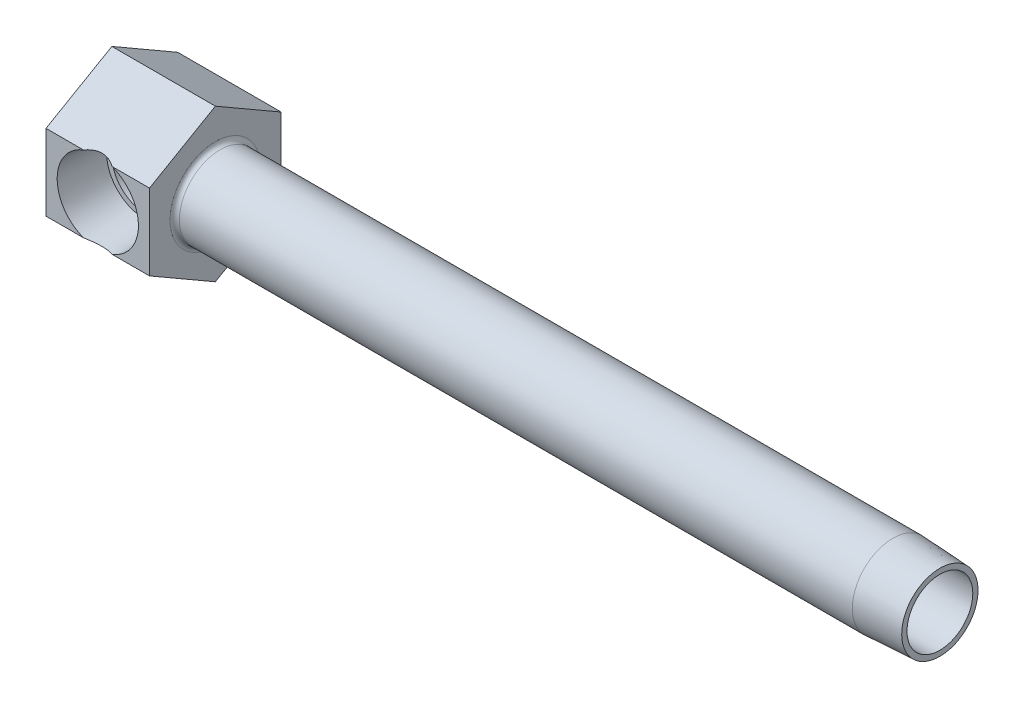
ISO-10303-21;
HEADER;
FILE_DESCRIPTION(('STEP AP214'),'2;1');
FILE_NAME('part.step','',(''),(''),'','','');
FILE_SCHEMA(('AUTOMOTIVE_DESIGN { 1 0 10303 214 1 1 1 1 }'));
ENDSEC;
DATA;
#1=APPLICATION_CONTEXT('core data for automotive mechanical design processes');
#2=APPLICATION_PROTOCOL_DEFINITION('international standard','automotive_design',2000,#1);
#3=PRODUCT_CONTEXT('',#1,'mechanical');
#4=PRODUCT('Part','Part','',(#3));
#5=PRODUCT_RELATED_PRODUCT_CATEGORY('part','',(#4));
#6=PRODUCT_DEFINITION_FORMATION('','',#4);
#7=PRODUCT_DEFINITION_CONTEXT('part definition',#1,'design');
#8=PRODUCT_DEFINITION('design','',#6,#7);
#9=PRODUCT_DEFINITION_SHAPE('','',#8);
#10=(LENGTH_UNIT() NAMED_UNIT(*) SI_UNIT(.MILLI.,.METRE.));
#11=(NAMED_UNIT(*) PLANE_ANGLE_UNIT() SI_UNIT($,.RADIAN.));
#12=(NAMED_UNIT(*) SI_UNIT($,.STERADIAN.) SOLID_ANGLE_UNIT());
#13=UNCERTAINTY_MEASURE_WITH_UNIT(LENGTH_MEASURE(1.E-05),#10,'distance_accuracy_value','');
#14=(GEOMETRIC_REPRESENTATION_CONTEXT(3) GLOBAL_UNCERTAINTY_ASSIGNED_CONTEXT((#13)) GLOBAL_UNIT_ASSIGNED_CONTEXT((#10,
#11,#12)) REPRESENTATION_CONTEXT('',''));
#15=CARTESIAN_POINT('',(0.,0.,0.));
#16=DIRECTION('',(0.,0.,1.));
#17=DIRECTION('',(1.,0.,0.));
#18=AXIS2_PLACEMENT_3D('',#15,#16,#17);
#19=CARTESIAN_POINT('',(8.7376,0.,22.225));
#20=DIRECTION('',(0.,0.,1.));
#21=DIRECTION('',(1.,0.,0.));
#22=AXIS2_PLACEMENT_3D('',#19,#20,#21);
#23=CONICAL_SURFACE('',#22,6.858,0.0523598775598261);
#24=CARTESIAN_POINT('',(8.7376,-0.680996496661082,34.5170205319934));
#25=DIRECTION('',(0.,-0.866025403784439,-0.5));
#26=DIRECTION('',(0.,-0.5,0.866025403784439));
#27=AXIS2_PLACEMENT_3D('',#24,#25,#26);
#28=ELLIPSE('',#27,15.0043949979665,7.47122554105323);
#29=CARTESIAN_POINT('',(11.1603281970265,6.4158048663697,22.225));
#30=VERTEX_POINT('',#29);
#31=CARTESIAN_POINT('',(6.3148718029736,6.4158048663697,22.225));
#32=VERTEX_POINT('',#31);
#33=EDGE_CURVE('E180',#30,#32,#28,.F.);
#34=ORIENTED_EDGE('',*,*,#33,.T.);
#35=CARTESIAN_POINT('',(8.7376,0.,22.225));
#36=DIRECTION('',(0.,0.,-1.));
#37=DIRECTION('',(-1.,0.,0.));
#38=AXIS2_PLACEMENT_3D('',#35,#36,#37);
#39=CIRCLE('',#38,6.858);
#40=CARTESIAN_POINT('',(6.31487180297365,-6.41580486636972,22.225));
#41=VERTEX_POINT('',#40);
#42=EDGE_CURVE('E38',#41,#32,#39,.T.);
#43=ORIENTED_EDGE('',*,*,#42,.F.);
#44=CARTESIAN_POINT('',(8.7376,0.680996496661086,34.5170205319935));
#45=DIRECTION('',(0.,0.866025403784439,-0.5));
#46=DIRECTION('',(0.,0.5,0.866025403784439));
#47=AXIS2_PLACEMENT_3D('',#44,#45,#46);
#48=ELLIPSE('',#47,15.0043949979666,7.47122554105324);
#49=CARTESIAN_POINT('',(11.1603281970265,-6.4158048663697,22.225));
#50=VERTEX_POINT('',#49);
#51=EDGE_CURVE('E23',#41,#50,#48,.F.);
#52=ORIENTED_EDGE('',*,*,#51,.T.);
#53=EDGE_CURVE('E174',#30,#50,#39,.T.);
#54=ORIENTED_EDGE('',*,*,#53,.F.);
#55=EDGE_LOOP('',(#34,#43,#52,#54));
#56=FACE_BOUND('',#55,.T.);
#57=CARTESIAN_POINT('',(8.7376,0.,14.3002));
#58=DIRECTION('',(0.,0.,-1.));
#59=DIRECTION('',(-1.,0.,0.));
#60=AXIS2_PLACEMENT_3D('',#57,#58,#59);
#61=CIRCLE('',#60,6.44267883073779);
#62=CARTESIAN_POINT('',(13.3057672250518,-4.54312213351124,14.3002));
#63=VERTEX_POINT('',#62);
#64=CARTESIAN_POINT('',(13.3057672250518,4.54312213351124,14.3002));
#65=VERTEX_POINT('',#64);
#66=EDGE_CURVE('E172',#63,#65,#61,.T.);
#67=ORIENTED_EDGE('',*,*,#66,.T.);
#68=CARTESIAN_POINT('',(13.3056128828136,4.5432624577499,14.3));
#69=CARTESIAN_POINT('',(13.4050037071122,4.45290836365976,14.4287190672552));
#70=CARTESIAN_POINT('',(13.5038252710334,4.35690222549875,14.5539811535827));
#71=CARTESIAN_POINT('',(13.6989301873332,4.15324987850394,14.7972290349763));
#72=CARTESIAN_POINT('',(13.7952093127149,4.04558563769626,14.9152031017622));
#73=CARTESIAN_POINT('',(13.9843700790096,3.8175241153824,15.1441485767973));
#74=CARTESIAN_POINT('',(14.0772125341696,3.69701926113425,15.25504596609));
#75=CARTESIAN_POINT('',(14.2568464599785,3.44414434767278,15.4675620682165));
#76=CARTESIAN_POINT('',(14.3436418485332,3.31178210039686,15.5691868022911));
#77=CARTESIAN_POINT('',(14.5527686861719,2.96297657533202,15.8122617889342));
#78=CARTESIAN_POINT('',(14.6701286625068,2.73858307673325,15.9469651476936));
#79=CARTESIAN_POINT('',(14.8276174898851,2.38307262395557,16.1264780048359));
#80=CARTESIAN_POINT('',(14.8769849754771,2.26153631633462,16.1825173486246));
#81=CARTESIAN_POINT('',(14.9687772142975,2.01251511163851,16.2864098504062));
#82=CARTESIAN_POINT('',(15.0112056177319,1.88503338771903,16.3342673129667));
#83=CARTESIAN_POINT('',(15.088733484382,1.62324870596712,16.4215218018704));
#84=CARTESIAN_POINT('',(15.1237419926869,1.4888836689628,16.4608139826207));
#85=CARTESIAN_POINT('',(15.1849785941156,1.21573970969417,16.5294343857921));
#86=CARTESIAN_POINT('',(15.2112114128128,1.07696320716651,16.5587679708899));
#87=CARTESIAN_POINT('',(15.2542466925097,0.796159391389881,16.6068431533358));
#88=CARTESIAN_POINT('',(15.2710505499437,0.654132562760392,16.6255863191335));
#89=CARTESIAN_POINT('',(15.2947665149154,0.368243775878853,16.6520290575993));
#90=CARTESIAN_POINT('',(15.3016803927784,0.224382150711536,16.6597306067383));
#91=CARTESIAN_POINT('',(15.3051381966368,-0.0413792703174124,16.6635827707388));
#92=CARTESIAN_POINT('',(15.3031178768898,-0.163241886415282,16.6613326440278));
#93=CARTESIAN_POINT('',(15.2919140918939,-0.406265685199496,16.6488476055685));
#94=CARTESIAN_POINT('',(15.282728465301,-0.527426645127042,16.6386102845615));
#95=CARTESIAN_POINT('',(15.2573805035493,-0.768029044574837,16.6103343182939));
#96=CARTESIAN_POINT('',(15.2412218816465,-0.887471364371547,16.5922998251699));
#97=CARTESIAN_POINT('',(15.2022471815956,-1.1238947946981,16.5487418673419));
#98=CARTESIAN_POINT('',(15.1794285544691,-1.24087494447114,16.5232155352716));
#99=CARTESIAN_POINT('',(15.1030013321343,-1.58064044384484,16.4375716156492));
#100=CARTESIAN_POINT('',(15.0406598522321,-1.79907617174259,16.3675454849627));
#101=CARTESIAN_POINT('',(14.8959772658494,-2.2198653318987,16.2041288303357));
#102=CARTESIAN_POINT('',(14.8136249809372,-2.42220969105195,16.1107252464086));
#103=CARTESIAN_POINT('',(14.6581620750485,-2.75475802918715,15.9330467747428));
#104=CARTESIAN_POINT('',(14.588877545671,-2.88934500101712,15.8534887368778));
#105=CARTESIAN_POINT('',(14.4433958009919,-3.14876465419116,15.6853070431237));
#106=CARTESIAN_POINT('',(14.3671982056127,-3.27359679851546,15.5966828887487));
#107=CARTESIAN_POINT('',(14.2091096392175,-3.51355050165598,15.4112660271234));
#108=CARTESIAN_POINT('',(14.1272094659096,-3.62865566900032,15.3144600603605));
#109=CARTESIAN_POINT('',(13.9591121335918,-3.84892561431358,15.1136697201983));
#110=CARTESIAN_POINT('',(13.8729164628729,-3.95409379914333,15.0096878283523));
#111=CARTESIAN_POINT('',(13.7069469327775,-4.14374167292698,14.806812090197));
#112=CARTESIAN_POINT('',(13.62749258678,-4.22922772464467,14.7085925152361));
#113=CARTESIAN_POINT('',(13.4673498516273,-4.39212627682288,14.5076746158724));
#114=CARTESIAN_POINT('',(13.386669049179,-4.4695749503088,14.4049995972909));
#115=CARTESIAN_POINT('',(13.3056128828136,-4.5432624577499,14.3));
#116=B_SPLINE_CURVE_WITH_KNOTS('',3,(#68,#69,#70,#71,#72,#73,#74,#75,#76,#77,#78,#79,#80,#81,
#82,#83,#84,#85,#86,#87,#88,#89,#90,#91,#92,#93,#94,#95,#96,#97,#98,#99,#100,#101,#102,#103,
#104,#105,#106,#107,#108,#109,#110,#111,#112,#113,#114,#115),.UNSPECIFIED.,.F.,.F.,(4,2,2,2,2,2,
2,2,2,2,2,2,2,2,2,2,2,2,2,2,2,2,2,4),(0.,0.558072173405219,1.11702021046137,1.68108674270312,
2.24478434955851,3.10140634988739,3.52893103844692,3.95623010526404,4.38849766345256,
4.82053207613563,5.25250248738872,5.68439556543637,6.04963287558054,6.41498039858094,
6.7801336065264,7.14542675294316,7.85550743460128,8.56598569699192,9.07835413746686,
9.59075076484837,10.1039943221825,10.6170612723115,11.0743952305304,11.5295724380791),.UNSPECIFIED.);
#117=EDGE_CURVE('E131',#65,#63,#116,.T.);
#118=ORIENTED_EDGE('',*,*,#117,.T.);
#119=EDGE_LOOP('',(#67,#118));
#120=FACE_BOUND('',#119,.T.);
#121=ADVANCED_FACE('F15',(#56,#120),#23,.F.);
#122=CARTESIAN_POINT('',(15.1802788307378,0.,14.3002));
#123=DIRECTION('',(0.,0.,1.));
#124=DIRECTION('',(1.,0.,0.));
#125=AXIS2_PLACEMENT_3D('',#122,#123,#124);
#126=PLANE('',#125);
#127=ORIENTED_EDGE('',*,*,#66,.F.);
#128=DIRECTION('',(1.,0.,0.));
#129=VECTOR('',#128,1.);
#130=CARTESIAN_POINT('',(65.6255637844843,-4.54312213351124,14.3002));
#131=LINE('',#130,#129);
#132=CARTESIAN_POINT('',(11.9253,-4.54312213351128,14.3002));
#133=VERTEX_POINT('',#132);
#134=EDGE_CURVE('E129',#63,#133,#131,.F.);
#135=ORIENTED_EDGE('',*,*,#134,.T.);
#136=CARTESIAN_POINT('',(8.7376,0.,14.3002));
#137=DIRECTION('',(0.,0.,-1.));
#138=DIRECTION('',(-1.,0.,0.));
#139=AXIS2_PLACEMENT_3D('',#136,#137,#138);
#140=CIRCLE('',#139,5.5499);
#141=CARTESIAN_POINT('',(11.9253,4.54312213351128,14.3002));
#142=VERTEX_POINT('',#141);
#143=EDGE_CURVE('E121',#133,#142,#140,.T.);
#144=ORIENTED_EDGE('',*,*,#143,.T.);
#145=DIRECTION('',(1.,0.,0.));
#146=VECTOR('',#145,1.);
#147=CARTESIAN_POINT('',(65.6255637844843,4.54312213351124,14.3002));
#148=LINE('',#147,#146);
#149=EDGE_CURVE('E124',#142,#65,#148,.T.);
#150=ORIENTED_EDGE('',*,*,#149,.T.);
#151=EDGE_LOOP('',(#127,#135,#144,#150));
#152=FACE_BOUND('',#151,.T.);
#153=ADVANCED_FACE('F162',(#152),#126,.T.);
#154=CARTESIAN_POINT('',(8.7376,0.,27.6280516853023));
#155=DIRECTION('',(0.,0.,-1.));
#156=DIRECTION('',(-1.,0.,0.));
#157=AXIS2_PLACEMENT_3D('',#154,#155,#156);
#158=CYLINDRICAL_SURFACE('',#157,5.5499);
#159=ORIENTED_EDGE('',*,*,#143,.F.);
#160=CARTESIAN_POINT('',(8.7376,0.,11.1125));
#161=DIRECTION('',(0.707106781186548,0.,-0.707106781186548));
#162=DIRECTION('',(-0.707106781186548,0.,-0.707106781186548));
#163=AXIS2_PLACEMENT_3D('',#160,#161,#162);
#164=ELLIPSE('',#163,7.84874384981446,5.5499);
#165=CARTESIAN_POINT('',(8.7376,-5.5499,11.1125));
#166=VERTEX_POINT('',#165);
#167=EDGE_CURVE('E110',#133,#166,#164,.T.);
#168=ORIENTED_EDGE('',*,*,#167,.T.);
#169=CARTESIAN_POINT('',(8.7376,0.,11.1125));
#170=DIRECTION('',(-0.707106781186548,0.,-0.707106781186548));
#171=DIRECTION('',(0.707106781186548,0.,-0.707106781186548));
#172=AXIS2_PLACEMENT_3D('',#169,#170,#171);
#173=ELLIPSE('',#172,7.84874384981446,5.5499);
#174=CARTESIAN_POINT('',(13.4708637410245,-2.89786203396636,6.37923625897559));
#175=VERTEX_POINT('',#174);
#176=EDGE_CURVE('E106',#166,#175,#173,.F.);
#177=ORIENTED_EDGE('',*,*,#176,.T.);
#178=CARTESIAN_POINT('',(8.7376,0.,6.37923625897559));
#179=DIRECTION('',(0.,0.,-1.));
#180=DIRECTION('',(-1.,0.,0.));
#181=AXIS2_PLACEMENT_3D('',#178,#179,#180);
#182=CIRCLE('',#181,5.5499);
#183=CARTESIAN_POINT('',(13.4708637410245,2.89786203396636,6.37923625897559));
#184=VERTEX_POINT('',#183);
#185=EDGE_CURVE('E177',#175,#184,#182,.T.);
#186=ORIENTED_EDGE('',*,*,#185,.T.);
#187=CARTESIAN_POINT('',(8.7376,5.5499,11.1125));
#188=VERTEX_POINT('',#187);
#189=EDGE_CURVE('E30',#184,#188,#173,.F.);
#190=ORIENTED_EDGE('',*,*,#189,.T.);
#191=EDGE_CURVE('E122',#188,#142,#164,.T.);
#192=ORIENTED_EDGE('',*,*,#191,.T.);
#193=EDGE_LOOP('',(#159,#168,#177,#186,#190,#192));
#194=FACE_BOUND('',#193,.T.);
#195=ADVANCED_FACE('F118',(#194),#158,.F.);
#196=CARTESIAN_POINT('',(8.7376,0.,6.37923625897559));
#197=DIRECTION('',(0.,0.,1.));
#198=DIRECTION('',(1.,0.,0.));
#199=AXIS2_PLACEMENT_3D('',#196,#197,#198);
#200=CONICAL_SURFACE('',#199,5.5499,1.04719755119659);
#201=CARTESIAN_POINT('',(8.7376,0.,3.175));
#202=VERTEX_POINT('',#201);
#203=VERTEX_LOOP('',#202);
#204=FACE_BOUND('',#203,.T.);
#205=ORIENTED_EDGE('',*,*,#185,.F.);
#206=CARTESIAN_POINT('',(13.4710699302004,-2.89818868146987,6.37943625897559));
#207=CARTESIAN_POINT('',(13.420685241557,-2.81852795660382,6.33063423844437));
#208=CARTESIAN_POINT('',(13.3737513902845,-2.73601453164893,6.28289768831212));
#209=CARTESIAN_POINT('',(13.2869939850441,-2.56583570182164,6.19038737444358));
#210=CARTESIAN_POINT('',(13.2471660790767,-2.47817349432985,6.14561180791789));
#211=CARTESIAN_POINT('',(13.1751547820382,-2.29911606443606,6.06025322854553));
#212=CARTESIAN_POINT('',(13.1428940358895,-2.20777091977,6.01963042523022));
#213=CARTESIAN_POINT('',(13.0851463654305,-2.02119544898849,5.9427479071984));
#214=CARTESIAN_POINT('',(13.0596596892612,-1.925964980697,5.90648835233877));
#215=CARTESIAN_POINT('',(13.0148514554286,-1.73255643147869,5.83897057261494));
#216=CARTESIAN_POINT('',(12.9955185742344,-1.63438413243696,5.80770321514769));
#217=CARTESIAN_POINT('',(12.9620830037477,-1.43563345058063,5.75050007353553));
#218=CARTESIAN_POINT('',(12.9479806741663,-1.33505490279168,5.72456465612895));
#219=CARTESIAN_POINT('',(12.9240526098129,-1.13183172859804,5.67823452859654));
#220=CARTESIAN_POINT('',(12.9142392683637,-1.02918199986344,5.65785593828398));
#221=CARTESIAN_POINT('',(12.8981074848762,-0.822623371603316,5.62290462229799));
#222=CARTESIAN_POINT('',(12.891789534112,-0.718714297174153,5.60833271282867));
#223=CARTESIAN_POINT('',(12.8810293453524,-0.489671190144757,5.58281999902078));
#224=CARTESIAN_POINT('',(12.8771967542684,-0.364365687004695,5.57314917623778));
#225=CARTESIAN_POINT('',(12.8729275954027,-0.113319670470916,5.56233429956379));
#226=CARTESIAN_POINT('',(12.8724915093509,0.0124209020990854,5.56119145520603));
#227=CARTESIAN_POINT('',(12.874939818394,0.263686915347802,5.567443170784));
#228=CARTESIAN_POINT('',(12.8778249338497,0.389212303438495,5.57483958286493));
#229=CARTESIAN_POINT('',(12.8874191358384,0.639322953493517,5.59811647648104));
#230=CARTESIAN_POINT('',(12.8941278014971,0.763908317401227,5.61399602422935));
#231=CARTESIAN_POINT('',(12.9116197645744,1.00072761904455,5.65236645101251));
#232=CARTESIAN_POINT('',(12.9220027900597,1.11310193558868,5.67417088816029));
#233=CARTESIAN_POINT('',(12.9479188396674,1.33574469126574,5.724531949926));
#234=CARTESIAN_POINT('',(12.9634519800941,1.44601308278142,5.75308872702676));
#235=CARTESIAN_POINT('',(13.00082798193,1.66326683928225,5.81649299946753));
#236=CARTESIAN_POINT('',(13.022650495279,1.77026157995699,5.8513200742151));
#237=CARTESIAN_POINT('',(13.0737132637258,1.98033019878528,5.92673676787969));
#238=CARTESIAN_POINT('',(13.1029503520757,2.08340572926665,5.9673239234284));
#239=CARTESIAN_POINT('',(13.1785970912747,2.31167706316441,6.06504898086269));
#240=CARTESIAN_POINT('',(13.2275080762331,2.4354192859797,6.12371071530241));
#241=CARTESIAN_POINT('',(13.3111431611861,2.61414296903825,6.21635789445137));
#242=CARTESIAN_POINT('',(13.3408272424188,2.67271819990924,6.24810824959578));
#243=CARTESIAN_POINT('',(13.4034989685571,2.78735967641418,6.31288069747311));
#244=CARTESIAN_POINT('',(13.4364871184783,2.84342553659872,6.34590298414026));
#245=CARTESIAN_POINT('',(13.4710699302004,2.89818868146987,6.37943625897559));
#246=B_SPLINE_CURVE_WITH_KNOTS('',3,(#206,#207,#208,#209,#210,#211,#212,#213,#214,#215,#216,
#217,#218,#219,#220,#221,#222,#223,#224,#225,#226,#227,#228,#229,#230,#231,#232,#233,#234,#235,
#236,#237,#238,#239,#240,#241,#242,#243,#244,#245),.UNSPECIFIED.,.F.,.F.,(4,2,2,2,2,2,2,2,2,2,2,
2,2,2,2,2,2,2,2,4),(0.,0.318348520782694,0.636501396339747,0.951244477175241,1.26599908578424,
1.58017112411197,1.89436476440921,2.20946038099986,2.52460027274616,2.90145665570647,
3.27836648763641,3.65535808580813,4.0323081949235,4.3768235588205,4.721346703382,
5.06476748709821,5.40804184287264,5.8430906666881,6.06180090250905,6.28054461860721),.UNSPECIFIED.);
#247=EDGE_CURVE('E112',#175,#184,#246,.T.);
#248=ORIENTED_EDGE('',*,*,#247,.T.);
#249=EDGE_LOOP('',(#205,#248));
#250=FACE_BOUND('',#249,.T.);
#251=ADVANCED_FACE('F155',(#204,#250),#200,.F.);
#252=CARTESIAN_POINT('',(139.7,0.,11.1125));
#253=DIRECTION('',(-1.,0.,0.));
#254=DIRECTION('',(0.,0.,1.));
#255=AXIS2_PLACEMENT_3D('',#252,#253,#254);
#256=PLANE('',#255);
#257=CARTESIAN_POINT('',(139.7,0.,11.1125));
#258=DIRECTION('',(-1.,0.,0.));
#259=DIRECTION('',(0.,0.,1.));
#260=AXIS2_PLACEMENT_3D('',#257,#258,#259);
#261=CIRCLE('',#260,6.44267883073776);
#262=CARTESIAN_POINT('',(139.7,0.,17.5551788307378));
#263=VERTEX_POINT('',#262);
#264=EDGE_CURVE('E10',#263,#263,#261,.T.);
#265=ORIENTED_EDGE('',*,*,#264,.F.);
#266=EDGE_LOOP('',(#265));
#267=FACE_BOUND('',#266,.T.);
#268=CARTESIAN_POINT('',(139.7,0.,11.1125));
#269=DIRECTION('',(1.,0.,0.));
#270=DIRECTION('',(0.,0.,-1.));
#271=AXIS2_PLACEMENT_3D('',#268,#269,#270);
#272=CIRCLE('',#271,5.5499);
#273=CARTESIAN_POINT('',(139.7,0.,5.5626));
#274=VERTEX_POINT('',#273);
#275=EDGE_CURVE('E154',#274,#274,#272,.T.);
#276=ORIENTED_EDGE('',*,*,#275,.F.);
#277=EDGE_LOOP('',(#276));
#278=FACE_BOUND('',#277,.T.);
#279=ADVANCED_FACE('F159',(#267,#278),#256,.F.);
#280=CARTESIAN_POINT('',(139.7,0.,11.1125));
#281=DIRECTION('',(-1.,0.,0.));
#282=DIRECTION('',(0.,0.,1.));
#283=AXIS2_PLACEMENT_3D('',#280,#281,#282);
#284=CYLINDRICAL_SURFACE('',#283,6.858);
#285=CARTESIAN_POINT('',(18.2499,0.,11.1125));
#286=DIRECTION('',(-1.,0.,0.));
#287=DIRECTION('',(0.,-1.,0.));
#288=AXIS2_PLACEMENT_3D('',#285,#286,#287);
#289=CIRCLE('',#288,6.858);
#290=CARTESIAN_POINT('',(18.2499,-6.858,11.1125));
#291=VERTEX_POINT('',#290);
#292=EDGE_CURVE('E239',#291,#291,#289,.F.);
#293=ORIENTED_EDGE('',*,*,#292,.T.);
#294=EDGE_LOOP('',(#293));
#295=FACE_BOUND('',#294,.T.);
#296=CARTESIAN_POINT('',(131.7752,0.,11.1125));
#297=DIRECTION('',(-1.,0.,0.));
#298=DIRECTION('',(0.,0.,1.));
#299=AXIS2_PLACEMENT_3D('',#296,#297,#298);
#300=CIRCLE('',#299,6.858);
#301=CARTESIAN_POINT('',(131.7752,0.,17.9705));
#302=VERTEX_POINT('',#301);
#303=EDGE_CURVE('E138',#302,#302,#300,.T.);
#304=ORIENTED_EDGE('',*,*,#303,.T.);
#305=EDGE_LOOP('',(#304));
#306=FACE_BOUND('',#305,.T.);
#307=ADVANCED_FACE('F289',(#295,#306),#284,.T.);
#308=CARTESIAN_POINT('',(17.4625,12.8316097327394,11.1125));
#309=DIRECTION('',(0.,-0.866025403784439,-0.5));
#310=DIRECTION('',(0.,0.5,-0.866025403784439));
#311=AXIS2_PLACEMENT_3D('',#308,#309,#310);
#312=PLANE('',#311);
#313=ORIENTED_EDGE('',*,*,#33,.F.);
#314=DIRECTION('',(-1.,0.,0.));
#315=VECTOR('',#314,1.);
#316=CARTESIAN_POINT('',(17.4625,6.4158048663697,22.225));
#317=LINE('',#316,#315);
#318=CARTESIAN_POINT('',(17.4625,6.4158048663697,22.225));
#319=VERTEX_POINT('',#318);
#320=EDGE_CURVE('E224',#319,#30,#317,.T.);
#321=ORIENTED_EDGE('',*,*,#320,.F.);
#322=DIRECTION('',(0.,-0.5,0.866025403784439));
#323=VECTOR('',#322,1.);
#324=CARTESIAN_POINT('',(17.4625,12.8316097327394,11.1125));
#325=LINE('',#324,#323);
#326=CARTESIAN_POINT('',(17.4625,12.8316097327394,11.1125));
#327=VERTEX_POINT('',#326);
#328=EDGE_CURVE('E208',#327,#319,#325,.T.);
#329=ORIENTED_EDGE('',*,*,#328,.F.);
#330=DIRECTION('',(-1.,0.,0.));
#331=VECTOR('',#330,1.);
#332=CARTESIAN_POINT('',(17.4625,12.8316097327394,11.1125));
#333=LINE('',#332,#331);
#334=CARTESIAN_POINT('',(0.,12.8316097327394,11.1125));
#335=VERTEX_POINT('',#334);
#336=EDGE_CURVE('E227',#327,#335,#333,.T.);
#337=ORIENTED_EDGE('',*,*,#336,.T.);
#338=DIRECTION('',(0.,-0.5,0.866025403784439));
#339=VECTOR('',#338,1.);
#340=CARTESIAN_POINT('',(0.,12.8316097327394,11.1125));
#341=LINE('',#340,#339);
#342=CARTESIAN_POINT('',(0.,6.4158048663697,22.225));
#343=VERTEX_POINT('',#342);
#344=EDGE_CURVE('E189',#335,#343,#341,.T.);
#345=ORIENTED_EDGE('',*,*,#344,.T.);
#346=EDGE_CURVE('E223',#32,#343,#317,.T.);
#347=ORIENTED_EDGE('',*,*,#346,.F.);
#348=EDGE_LOOP('',(#313,#321,#329,#337,#345,#347));
#349=FACE_BOUND('',#348,.T.);
#350=ADVANCED_FACE('F254',(#349),#312,.F.);
#351=CARTESIAN_POINT('',(17.4625,6.4158048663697,22.225));
#352=DIRECTION('',(0.,0.,-1.));
#353=DIRECTION('',(0.,1.,0.));
#354=AXIS2_PLACEMENT_3D('',#351,#352,#353);
#355=PLANE('',#354);
#356=ORIENTED_EDGE('',*,*,#42,.T.);
#357=ORIENTED_EDGE('',*,*,#346,.T.);
#358=DIRECTION('',(0.,-1.,0.));
#359=VECTOR('',#358,1.);
#360=CARTESIAN_POINT('',(0.,6.4158048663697,22.225));
#361=LINE('',#360,#359);
#362=CARTESIAN_POINT('',(0.,-6.41580486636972,22.225));
#363=VERTEX_POINT('',#362);
#364=EDGE_CURVE('E193',#343,#363,#361,.T.);
#365=ORIENTED_EDGE('',*,*,#364,.T.);
#366=DIRECTION('',(-1.,0.,0.));
#367=VECTOR('',#366,1.);
#368=CARTESIAN_POINT('',(17.4625,-6.41580486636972,22.225));
#369=LINE('',#368,#367);
#370=EDGE_CURVE('E219',#41,#363,#369,.T.);
#371=ORIENTED_EDGE('',*,*,#370,.F.);
#372=EDGE_LOOP('',(#356,#357,#365,#371));
#373=FACE_BOUND('',#372,.T.);
#374=ADVANCED_FACE('F257',(#373),#355,.F.);
#375=ORIENTED_EDGE('',*,*,#53,.T.);
#376=CARTESIAN_POINT('',(17.4625,-6.41580486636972,22.225));
#377=VERTEX_POINT('',#376);
#378=EDGE_CURVE('E220',#377,#50,#369,.T.);
#379=ORIENTED_EDGE('',*,*,#378,.F.);
#380=DIRECTION('',(0.,-1.,0.));
#381=VECTOR('',#380,1.);
#382=CARTESIAN_POINT('',(17.4625,6.4158048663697,22.225));
#383=LINE('',#382,#381);
#384=EDGE_CURVE('E210',#319,#377,#383,.T.);
#385=ORIENTED_EDGE('',*,*,#384,.F.);
#386=ORIENTED_EDGE('',*,*,#320,.T.);
#387=EDGE_LOOP('',(#375,#379,#385,#386));
#388=FACE_BOUND('',#387,.T.);
#389=ADVANCED_FACE('F250',(#388),#355,.F.);
#390=CARTESIAN_POINT('',(17.4625,-6.41580486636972,22.225));
#391=DIRECTION('',(0.,0.866025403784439,-0.5));
#392=DIRECTION('',(0.,0.5,0.866025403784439));
#393=AXIS2_PLACEMENT_3D('',#390,#391,#392);
#394=PLANE('',#393);
#395=ORIENTED_EDGE('',*,*,#51,.F.);
#396=ORIENTED_EDGE('',*,*,#370,.T.);
#397=DIRECTION('',(0.,-0.5,-0.866025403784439));
#398=VECTOR('',#397,1.);
#399=CARTESIAN_POINT('',(0.,-6.41580486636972,22.225));
#400=LINE('',#399,#398);
#401=CARTESIAN_POINT('',(0.,-12.8316097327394,11.1125));
#402=VERTEX_POINT('',#401);
#403=EDGE_CURVE('E197',#363,#402,#400,.T.);
#404=ORIENTED_EDGE('',*,*,#403,.T.);
#405=DIRECTION('',(-1.,0.,0.));
#406=VECTOR('',#405,1.);
#407=CARTESIAN_POINT('',(17.4625,-12.8316097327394,11.1125));
#408=LINE('',#407,#406);
#409=CARTESIAN_POINT('',(17.4625,-12.8316097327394,11.1125));
#410=VERTEX_POINT('',#409);
#411=EDGE_CURVE('E214',#410,#402,#408,.T.);
#412=ORIENTED_EDGE('',*,*,#411,.F.);
#413=DIRECTION('',(0.,-0.5,-0.866025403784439));
#414=VECTOR('',#413,1.);
#415=CARTESIAN_POINT('',(17.4625,-6.41580486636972,22.225));
#416=LINE('',#415,#414);
#417=EDGE_CURVE('E212',#377,#410,#416,.T.);
#418=ORIENTED_EDGE('',*,*,#417,.F.);
#419=ORIENTED_EDGE('',*,*,#378,.T.);
#420=EDGE_LOOP('',(#395,#396,#404,#412,#418,#419));
#421=FACE_BOUND('',#420,.T.);
#422=ADVANCED_FACE('F246',(#421),#394,.F.);
#423=CARTESIAN_POINT('',(17.4625,-12.8316097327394,11.1125));
#424=DIRECTION('',(0.,0.866025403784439,0.5));
#425=DIRECTION('',(0.,-0.5,0.866025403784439));
#426=AXIS2_PLACEMENT_3D('',#423,#424,#425);
#427=PLANE('',#426);
#428=DIRECTION('',(0.,0.5,-0.866025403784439));
#429=VECTOR('',#428,1.);
#430=CARTESIAN_POINT('',(0.,-12.8316097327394,11.1125));
#431=LINE('',#430,#429);
#432=CARTESIAN_POINT('',(0.,-6.41580486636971,0.));
#433=VERTEX_POINT('',#432);
#434=EDGE_CURVE('E182',#402,#433,#431,.T.);
#435=ORIENTED_EDGE('',*,*,#434,.T.);
#436=DIRECTION('',(-1.,0.,0.));
#437=VECTOR('',#436,1.);
#438=CARTESIAN_POINT('',(17.4625,-6.41580486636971,0.));
#439=LINE('',#438,#437);
#440=CARTESIAN_POINT('',(17.4625,-6.41580486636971,0.));
#441=VERTEX_POINT('',#440);
#442=EDGE_CURVE('E233',#441,#433,#439,.T.);
#443=ORIENTED_EDGE('',*,*,#442,.F.);
#444=DIRECTION('',(0.,0.5,-0.866025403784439));
#445=VECTOR('',#444,1.);
#446=CARTESIAN_POINT('',(17.4625,-12.8316097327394,11.1125));
#447=LINE('',#446,#445);
#448=EDGE_CURVE('E200',#410,#441,#447,.T.);
#449=ORIENTED_EDGE('',*,*,#448,.F.);
#450=ORIENTED_EDGE('',*,*,#411,.T.);
#451=EDGE_LOOP('',(#435,#443,#449,#450));
#452=FACE_BOUND('',#451,.T.);
#453=ADVANCED_FACE('F17',(#452),#427,.F.);
#454=CARTESIAN_POINT('',(17.4625,-6.41580486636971,0.));
#455=DIRECTION('',(0.,0.,1.));
#456=DIRECTION('',(1.,0.,0.));
#457=AXIS2_PLACEMENT_3D('',#454,#455,#456);
#458=PLANE('',#457);
#459=DIRECTION('',(0.,1.,0.));
#460=VECTOR('',#459,1.);
#461=CARTESIAN_POINT('',(0.,-6.41580486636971,0.));
#462=LINE('',#461,#460);
#463=CARTESIAN_POINT('',(0.,6.41580486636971,0.));
#464=VERTEX_POINT('',#463);
#465=EDGE_CURVE('E183',#433,#464,#462,.T.);
#466=ORIENTED_EDGE('',*,*,#465,.T.);
#467=DIRECTION('',(-1.,0.,0.));
#468=VECTOR('',#467,1.);
#469=CARTESIAN_POINT('',(17.4625,6.41580486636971,0.));
#470=LINE('',#469,#468);
#471=CARTESIAN_POINT('',(17.4625,6.41580486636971,0.));
#472=VERTEX_POINT('',#471);
#473=EDGE_CURVE('E230',#472,#464,#470,.T.);
#474=ORIENTED_EDGE('',*,*,#473,.F.);
#475=DIRECTION('',(0.,1.,0.));
#476=VECTOR('',#475,1.);
#477=CARTESIAN_POINT('',(17.4625,-6.41580486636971,0.));
#478=LINE('',#477,#476);
#479=EDGE_CURVE('E204',#441,#472,#478,.T.);
#480=ORIENTED_EDGE('',*,*,#479,.F.);
#481=ORIENTED_EDGE('',*,*,#442,.T.);
#482=EDGE_LOOP('',(#466,#474,#480,#481));
#483=FACE_BOUND('',#482,.T.);
#484=ADVANCED_FACE('F270',(#483),#458,.F.);
#485=CARTESIAN_POINT('',(17.4625,6.4158048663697,0.));
#486=DIRECTION('',(0.,-0.866025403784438,0.5));
#487=DIRECTION('',(0.,-0.5,-0.866025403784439));
#488=AXIS2_PLACEMENT_3D('',#485,#486,#487);
#489=PLANE('',#488);
#490=DIRECTION('',(0.,0.5,0.866025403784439));
#491=VECTOR('',#490,1.);
#492=CARTESIAN_POINT('',(0.,6.4158048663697,0.));
#493=LINE('',#492,#491);
#494=EDGE_CURVE('E186',#464,#335,#493,.T.);
#495=ORIENTED_EDGE('',*,*,#494,.T.);
#496=ORIENTED_EDGE('',*,*,#336,.F.);
#497=DIRECTION('',(0.,0.5,0.866025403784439));
#498=VECTOR('',#497,1.);
#499=CARTESIAN_POINT('',(17.4625,6.4158048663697,0.));
#500=LINE('',#499,#498);
#501=EDGE_CURVE('E206',#472,#327,#500,.T.);
#502=ORIENTED_EDGE('',*,*,#501,.F.);
#503=ORIENTED_EDGE('',*,*,#473,.T.);
#504=EDGE_LOOP('',(#495,#496,#502,#503));
#505=FACE_BOUND('',#504,.T.);
#506=ADVANCED_FACE('F276',(#505),#489,.F.);
#507=CARTESIAN_POINT('',(17.4625,-19.2474145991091,22.225));
#508=DIRECTION('',(-1.,0.,0.));
#509=DIRECTION('',(0.,-1.,0.));
#510=AXIS2_PLACEMENT_3D('',#507,#508,#509);
#511=PLANE('',#510);
#512=CARTESIAN_POINT('',(17.4625,0.,11.1125));
#513=DIRECTION('',(-1.,0.,0.));
#514=DIRECTION('',(0.,-1.,0.));
#515=AXIS2_PLACEMENT_3D('',#512,#513,#514);
#516=CIRCLE('',#515,7.6454);
#517=CARTESIAN_POINT('',(17.4625,-7.6454,11.1125));
#518=VERTEX_POINT('',#517);
#519=EDGE_CURVE('E236',#518,#518,#516,.T.);
#520=ORIENTED_EDGE('',*,*,#519,.T.);
#521=EDGE_LOOP('',(#520));
#522=FACE_BOUND('',#521,.T.);
#523=ORIENTED_EDGE('',*,*,#448,.T.);
#524=ORIENTED_EDGE('',*,*,#479,.T.);
#525=ORIENTED_EDGE('',*,*,#501,.T.);
#526=ORIENTED_EDGE('',*,*,#328,.T.);
#527=ORIENTED_EDGE('',*,*,#384,.T.);
#528=ORIENTED_EDGE('',*,*,#417,.T.);
#529=EDGE_LOOP('',(#523,#524,#525,#526,#527,#528));
#530=FACE_BOUND('',#529,.T.);
#531=ADVANCED_FACE('F273',(#522,#530),#511,.F.);
#532=CARTESIAN_POINT('',(0.,-19.2474145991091,22.225));
#533=DIRECTION('',(-1.,0.,0.));
#534=DIRECTION('',(0.,-1.,0.));
#535=AXIS2_PLACEMENT_3D('',#532,#533,#534);
#536=PLANE('',#535);
#537=ORIENTED_EDGE('',*,*,#434,.F.);
#538=ORIENTED_EDGE('',*,*,#403,.F.);
#539=ORIENTED_EDGE('',*,*,#364,.F.);
#540=ORIENTED_EDGE('',*,*,#344,.F.);
#541=ORIENTED_EDGE('',*,*,#494,.F.);
#542=ORIENTED_EDGE('',*,*,#465,.F.);
#543=EDGE_LOOP('',(#537,#538,#539,#540,#541,#542));
#544=FACE_BOUND('',#543,.T.);
#545=ADVANCED_FACE('F265',(#544),#536,.T.);
#546=CARTESIAN_POINT('',(18.2499,0.,11.1125));
#547=DIRECTION('',(-1.,0.,0.));
#548=DIRECTION('',(0.,-1.,0.));
#549=AXIS2_PLACEMENT_3D('',#546,#547,#548);
#550=TOROIDAL_SURFACE('',#549,7.6454,0.7874);
#551=ORIENTED_EDGE('',*,*,#292,.F.);
#552=EDGE_LOOP('',(#551));
#553=FACE_BOUND('',#552,.T.);
#554=ORIENTED_EDGE('',*,*,#519,.F.);
#555=EDGE_LOOP('',(#554));
#556=FACE_BOUND('',#555,.T.);
#557=ADVANCED_FACE('F296',(#553,#556),#550,.F.);
#558=CARTESIAN_POINT('',(63.7116652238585,0.,11.1125));
#559=DIRECTION('',(-1.,0.,0.));
#560=DIRECTION('',(0.,0.,1.));
#561=AXIS2_PLACEMENT_3D('',#558,#559,#560);
#562=CONICAL_SURFACE('',#561,10.4250587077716,0.0523598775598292);
#563=ORIENTED_EDGE('',*,*,#264,.T.);
#564=EDGE_LOOP('',(#563));
#565=FACE_BOUND('',#564,.T.);
#566=ORIENTED_EDGE('',*,*,#303,.F.);
#567=EDGE_LOOP('',(#566));
#568=FACE_BOUND('',#567,.T.);
#569=ADVANCED_FACE('F146',(#565,#568),#562,.T.);
#570=CARTESIAN_POINT('',(65.6255637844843,0.,11.1125));
#571=DIRECTION('',(1.,0.,0.));
#572=DIRECTION('',(0.,0.,-1.));
#573=AXIS2_PLACEMENT_3D('',#570,#571,#572);
#574=CYLINDRICAL_SURFACE('',#573,5.5499);
#575=ORIENTED_EDGE('',*,*,#275,.T.);
#576=EDGE_LOOP('',(#575));
#577=FACE_BOUND('',#576,.T.);
#578=ORIENTED_EDGE('',*,*,#149,.F.);
#579=ORIENTED_EDGE('',*,*,#191,.F.);
#580=ORIENTED_EDGE('',*,*,#189,.F.);
#581=ORIENTED_EDGE('',*,*,#247,.F.);
#582=ORIENTED_EDGE('',*,*,#176,.F.);
#583=ORIENTED_EDGE('',*,*,#167,.F.);
#584=ORIENTED_EDGE('',*,*,#134,.F.);
#585=ORIENTED_EDGE('',*,*,#117,.F.);
#586=EDGE_LOOP('',(#578,#579,#580,#581,#582,#583,#584,#585));
#587=FACE_BOUND('',#586,.T.);
#588=ADVANCED_FACE('F108',(#577,#587),#574,.F.);
#589=CLOSED_SHELL('',(#121,#153,#195,#251,#279,#307,#350,#374,#389,#422,#453,#484,#506,#531,
#545,#557,#569,#588));
#590=MANIFOLD_SOLID_BREP('B1',#589);
#591=ADVANCED_BREP_SHAPE_REPRESENTATION('',(#18,#590),#14);
#592=SHAPE_DEFINITION_REPRESENTATION(#9,#591);
ENDSEC;
END-ISO-10303-21;
